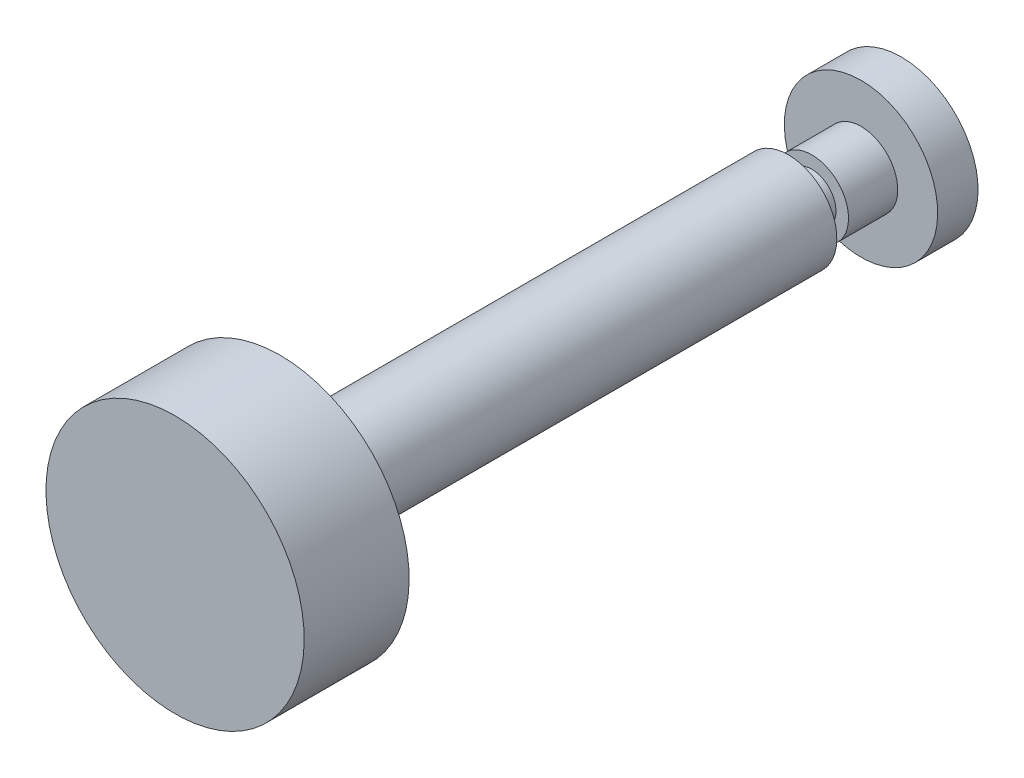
ISO-10303-21;
HEADER;
FILE_DESCRIPTION(('STEP AP214'),'2;1');
FILE_NAME('part.step','',(''),(''),'','','');
FILE_SCHEMA(('AUTOMOTIVE_DESIGN { 1 0 10303 214 1 1 1 1 }'));
ENDSEC;
DATA;
#1=APPLICATION_CONTEXT('core data for automotive mechanical design processes');
#2=APPLICATION_PROTOCOL_DEFINITION('international standard','automotive_design',2000,#1);
#3=PRODUCT_CONTEXT('',#1,'mechanical');
#4=PRODUCT('Part','Part','',(#3));
#5=PRODUCT_RELATED_PRODUCT_CATEGORY('part','',(#4));
#6=PRODUCT_DEFINITION_FORMATION('','',#4);
#7=PRODUCT_DEFINITION_CONTEXT('part definition',#1,'design');
#8=PRODUCT_DEFINITION('design','',#6,#7);
#9=PRODUCT_DEFINITION_SHAPE('','',#8);
#10=(LENGTH_UNIT() NAMED_UNIT(*) SI_UNIT(.MILLI.,.METRE.));
#11=(NAMED_UNIT(*) PLANE_ANGLE_UNIT() SI_UNIT($,.RADIAN.));
#12=(NAMED_UNIT(*) SI_UNIT($,.STERADIAN.) SOLID_ANGLE_UNIT());
#13=UNCERTAINTY_MEASURE_WITH_UNIT(LENGTH_MEASURE(1.E-05),#10,'distance_accuracy_value','');
#14=(GEOMETRIC_REPRESENTATION_CONTEXT(3) GLOBAL_UNCERTAINTY_ASSIGNED_CONTEXT((#13)) GLOBAL_UNIT_ASSIGNED_CONTEXT((#10,
#11,#12)) REPRESENTATION_CONTEXT('',''));
#15=CARTESIAN_POINT('',(0.,0.,0.));
#16=DIRECTION('',(0.,0.,1.));
#17=DIRECTION('',(1.,0.,0.));
#18=AXIS2_PLACEMENT_3D('',#15,#16,#17);
#19=CARTESIAN_POINT('',(0.,0.,0.));
#20=DIRECTION('',(0.,0.,1.));
#21=DIRECTION('',(0.,1.,0.));
#22=AXIS2_PLACEMENT_3D('',#19,#20,#21);
#23=PLANE('',#22);
#24=CARTESIAN_POINT('',(0.,0.,0.));
#25=DIRECTION('',(0.,0.,1.));
#26=DIRECTION('',(0.,1.,0.));
#27=AXIS2_PLACEMENT_3D('',#24,#25,#26);
#28=CIRCLE('',#27,9.5);
#29=CARTESIAN_POINT('',(0.,9.5,0.));
#30=VERTEX_POINT('',#29);
#31=EDGE_CURVE('E8',#30,#30,#28,.T.);
#32=ORIENTED_EDGE('',*,*,#31,.F.);
#33=EDGE_LOOP('',(#32));
#34=FACE_BOUND('',#33,.T.);
#35=ADVANCED_FACE('F12',(#34),#23,.F.);
#36=CARTESIAN_POINT('',(0.,0.,40.));
#37=DIRECTION('',(0.,0.,1.));
#38=DIRECTION('',(0.,1.,0.));
#39=AXIS2_PLACEMENT_3D('',#36,#37,#38);
#40=CYLINDRICAL_SURFACE('',#39,9.5);
#41=CARTESIAN_POINT('',(0.,0.,5.));
#42=DIRECTION('',(0.,0.,1.));
#43=DIRECTION('',(0.,1.,0.));
#44=AXIS2_PLACEMENT_3D('',#41,#42,#43);
#45=CIRCLE('',#44,9.5);
#46=CARTESIAN_POINT('',(0.,9.5,5.));
#47=VERTEX_POINT('',#46);
#48=EDGE_CURVE('E18',#47,#47,#45,.T.);
#49=ORIENTED_EDGE('',*,*,#48,.F.);
#50=EDGE_LOOP('',(#49));
#51=FACE_BOUND('',#50,.T.);
#52=ORIENTED_EDGE('',*,*,#31,.T.);
#53=EDGE_LOOP('',(#52));
#54=FACE_BOUND('',#53,.T.);
#55=ADVANCED_FACE('F71',(#51,#54),#40,.T.);
#56=CARTESIAN_POINT('',(0.,-9.5,5.));
#57=DIRECTION('',(0.,0.,-1.));
#58=DIRECTION('',(0.,-1.,0.));
#59=AXIS2_PLACEMENT_3D('',#56,#57,#58);
#60=PLANE('',#59);
#61=CARTESIAN_POINT('',(0.,0.,5.));
#62=DIRECTION('',(0.,0.,1.));
#63=DIRECTION('',(0.,1.,0.));
#64=AXIS2_PLACEMENT_3D('',#61,#62,#63);
#65=CIRCLE('',#64,4.55);
#66=CARTESIAN_POINT('',(0.,4.55,5.));
#67=VERTEX_POINT('',#66);
#68=EDGE_CURVE('E22',#67,#67,#65,.T.);
#69=ORIENTED_EDGE('',*,*,#68,.F.);
#70=EDGE_LOOP('',(#69));
#71=FACE_BOUND('',#70,.T.);
#72=ORIENTED_EDGE('',*,*,#48,.T.);
#73=EDGE_LOOP('',(#72));
#74=FACE_BOUND('',#73,.T.);
#75=ADVANCED_FACE('F76',(#71,#74),#60,.F.);
#76=CARTESIAN_POINT('',(0.,0.,40.));
#77=DIRECTION('',(0.,0.,1.));
#78=DIRECTION('',(0.,1.,0.));
#79=AXIS2_PLACEMENT_3D('',#76,#77,#78);
#80=CYLINDRICAL_SURFACE('',#79,4.55);
#81=CARTESIAN_POINT('',(0.,0.,11.1));
#82=DIRECTION('',(0.,0.,1.));
#83=DIRECTION('',(0.,1.,0.));
#84=AXIS2_PLACEMENT_3D('',#81,#82,#83);
#85=CIRCLE('',#84,4.55);
#86=CARTESIAN_POINT('',(0.,4.55,11.1));
#87=VERTEX_POINT('',#86);
#88=EDGE_CURVE('E26',#87,#87,#85,.T.);
#89=ORIENTED_EDGE('',*,*,#88,.F.);
#90=EDGE_LOOP('',(#89));
#91=FACE_BOUND('',#90,.T.);
#92=ORIENTED_EDGE('',*,*,#68,.T.);
#93=EDGE_LOOP('',(#92));
#94=FACE_BOUND('',#93,.T.);
#95=ADVANCED_FACE('F81',(#91,#94),#80,.T.);
#96=CARTESIAN_POINT('',(0.,-4.55,11.1));
#97=DIRECTION('',(0.,0.,-1.));
#98=DIRECTION('',(0.,-1.,0.));
#99=AXIS2_PLACEMENT_3D('',#96,#97,#98);
#100=PLANE('',#99);
#101=CARTESIAN_POINT('',(0.,0.,11.1));
#102=DIRECTION('',(0.,0.,1.));
#103=DIRECTION('',(0.,1.,0.));
#104=AXIS2_PLACEMENT_3D('',#101,#102,#103);
#105=CIRCLE('',#104,3.);
#106=CARTESIAN_POINT('',(0.,3.,11.1));
#107=VERTEX_POINT('',#106);
#108=EDGE_CURVE('E31',#107,#107,#105,.T.);
#109=ORIENTED_EDGE('',*,*,#108,.F.);
#110=EDGE_LOOP('',(#109));
#111=FACE_BOUND('',#110,.T.);
#112=ORIENTED_EDGE('',*,*,#88,.T.);
#113=EDGE_LOOP('',(#112));
#114=FACE_BOUND('',#113,.T.);
#115=ADVANCED_FACE('F87',(#111,#114),#100,.F.);
#116=CARTESIAN_POINT('',(0.,0.,40.));
#117=DIRECTION('',(0.,0.,1.));
#118=DIRECTION('',(0.,1.,0.));
#119=AXIS2_PLACEMENT_3D('',#116,#117,#118);
#120=CYLINDRICAL_SURFACE('',#119,3.);
#121=CARTESIAN_POINT('',(0.,0.,14.));
#122=DIRECTION('',(0.,0.,1.));
#123=DIRECTION('',(0.,1.,0.));
#124=AXIS2_PLACEMENT_3D('',#121,#122,#123);
#125=CIRCLE('',#124,3.);
#126=CARTESIAN_POINT('',(0.,3.,14.));
#127=VERTEX_POINT('',#126);
#128=EDGE_CURVE('E34',#127,#127,#125,.T.);
#129=ORIENTED_EDGE('',*,*,#128,.F.);
#130=EDGE_LOOP('',(#129));
#131=FACE_BOUND('',#130,.T.);
#132=ORIENTED_EDGE('',*,*,#108,.T.);
#133=EDGE_LOOP('',(#132));
#134=FACE_BOUND('',#133,.T.);
#135=ADVANCED_FACE('F91',(#131,#134),#120,.T.);
#136=CARTESIAN_POINT('',(0.,-3.,14.));
#137=DIRECTION('',(0.,0.,1.));
#138=DIRECTION('',(0.,1.,0.));
#139=AXIS2_PLACEMENT_3D('',#136,#137,#138);
#140=PLANE('',#139);
#141=CARTESIAN_POINT('',(0.,0.,14.));
#142=DIRECTION('',(0.,0.,1.));
#143=DIRECTION('',(0.,1.,0.));
#144=AXIS2_PLACEMENT_3D('',#141,#142,#143);
#145=CIRCLE('',#144,6.);
#146=CARTESIAN_POINT('',(0.,6.,14.));
#147=VERTEX_POINT('',#146);
#148=EDGE_CURVE('E37',#147,#147,#145,.T.);
#149=ORIENTED_EDGE('',*,*,#148,.F.);
#150=EDGE_LOOP('',(#149));
#151=FACE_BOUND('',#150,.T.);
#152=ORIENTED_EDGE('',*,*,#128,.T.);
#153=EDGE_LOOP('',(#152));
#154=FACE_BOUND('',#153,.T.);
#155=ADVANCED_FACE('F67',(#151,#154),#140,.F.);
#156=CARTESIAN_POINT('',(0.,0.,40.));
#157=DIRECTION('',(0.,0.,1.));
#158=DIRECTION('',(0.,1.,0.));
#159=AXIS2_PLACEMENT_3D('',#156,#157,#158);
#160=CYLINDRICAL_SURFACE('',#159,6.);
#161=CARTESIAN_POINT('',(0.,0.,77.));
#162=DIRECTION('',(0.,0.,1.));
#163=DIRECTION('',(0.,1.,0.));
#164=AXIS2_PLACEMENT_3D('',#161,#162,#163);
#165=CIRCLE('',#164,6.);
#166=CARTESIAN_POINT('',(0.,6.,77.));
#167=VERTEX_POINT('',#166);
#168=EDGE_CURVE('E40',#167,#167,#165,.T.);
#169=ORIENTED_EDGE('',*,*,#168,.F.);
#170=EDGE_LOOP('',(#169));
#171=FACE_BOUND('',#170,.T.);
#172=ORIENTED_EDGE('',*,*,#148,.T.);
#173=EDGE_LOOP('',(#172));
#174=FACE_BOUND('',#173,.T.);
#175=ADVANCED_FACE('F60',(#171,#174),#160,.T.);
#176=CARTESIAN_POINT('',(0.,-16.,77.));
#177=DIRECTION('',(0.,0.,-1.));
#178=DIRECTION('',(0.,-1.,0.));
#179=AXIS2_PLACEMENT_3D('',#176,#177,#178);
#180=PLANE('',#179);
#181=ORIENTED_EDGE('',*,*,#168,.T.);
#182=EDGE_LOOP('',(#181));
#183=FACE_BOUND('',#182,.T.);
#184=CARTESIAN_POINT('',(0.,0.,77.));
#185=DIRECTION('',(0.,0.,1.));
#186=DIRECTION('',(0.,1.,0.));
#187=AXIS2_PLACEMENT_3D('',#184,#185,#186);
#188=CIRCLE('',#187,16.);
#189=CARTESIAN_POINT('',(0.,16.,77.));
#190=VERTEX_POINT('',#189);
#191=EDGE_CURVE('E43',#190,#190,#188,.T.);
#192=ORIENTED_EDGE('',*,*,#191,.F.);
#193=EDGE_LOOP('',(#192));
#194=FACE_BOUND('',#193,.T.);
#195=ADVANCED_FACE('F55',(#183,#194),#180,.T.);
#196=CARTESIAN_POINT('',(0.,0.,40.));
#197=DIRECTION('',(0.,0.,1.));
#198=DIRECTION('',(0.,1.,0.));
#199=AXIS2_PLACEMENT_3D('',#196,#197,#198);
#200=CYLINDRICAL_SURFACE('',#199,16.);
#201=CARTESIAN_POINT('',(0.,0.,90.));
#202=DIRECTION('',(0.,0.,1.));
#203=DIRECTION('',(0.,1.,0.));
#204=AXIS2_PLACEMENT_3D('',#201,#202,#203);
#205=CIRCLE('',#204,16.);
#206=CARTESIAN_POINT('',(0.,16.,90.));
#207=VERTEX_POINT('',#206);
#208=EDGE_CURVE('E46',#207,#207,#205,.T.);
#209=ORIENTED_EDGE('',*,*,#208,.F.);
#210=EDGE_LOOP('',(#209));
#211=FACE_BOUND('',#210,.T.);
#212=ORIENTED_EDGE('',*,*,#191,.T.);
#213=EDGE_LOOP('',(#212));
#214=FACE_BOUND('',#213,.T.);
#215=ADVANCED_FACE('F52',(#211,#214),#200,.T.);
#216=CARTESIAN_POINT('',(0.,-16.,90.));
#217=DIRECTION('',(0.,0.,-1.));
#218=DIRECTION('',(0.,-1.,0.));
#219=AXIS2_PLACEMENT_3D('',#216,#217,#218);
#220=PLANE('',#219);
#221=ORIENTED_EDGE('',*,*,#208,.T.);
#222=EDGE_LOOP('',(#221));
#223=FACE_BOUND('',#222,.T.);
#224=ADVANCED_FACE('F50',(#223),#220,.F.);
#225=CLOSED_SHELL('',(#35,#55,#75,#95,#115,#135,#155,#175,#195,#215,#224));
#226=MANIFOLD_SOLID_BREP('B1',#225);
#227=ADVANCED_BREP_SHAPE_REPRESENTATION('',(#18,#226),#14);
#228=SHAPE_DEFINITION_REPRESENTATION(#9,#227);
ENDSEC;
END-ISO-10303-21;
